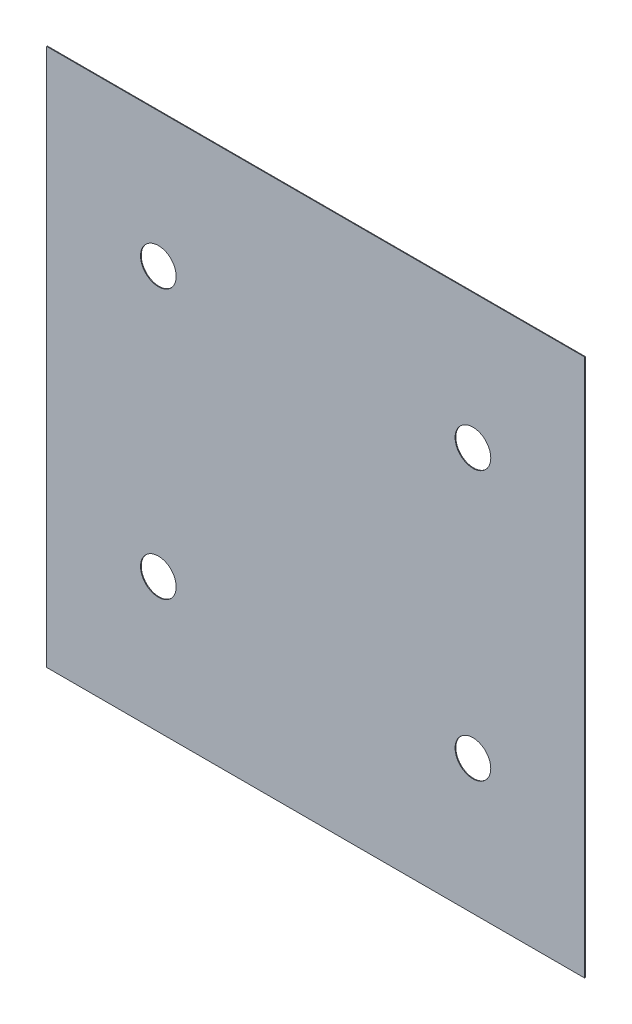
ISO-10303-21;
HEADER;
FILE_DESCRIPTION(('STEP AP214'),'2;1');
FILE_NAME('part.step','',(''),(''),'','','');
FILE_SCHEMA(('AUTOMOTIVE_DESIGN { 1 0 10303 214 1 1 1 1 }'));
ENDSEC;
DATA;
#1=APPLICATION_CONTEXT('core data for automotive mechanical design processes');
#2=APPLICATION_PROTOCOL_DEFINITION('international standard','automotive_design',2000,#1);
#3=PRODUCT_CONTEXT('',#1,'mechanical');
#4=PRODUCT('Part','Part','',(#3));
#5=PRODUCT_RELATED_PRODUCT_CATEGORY('part','',(#4));
#6=PRODUCT_DEFINITION_FORMATION('','',#4);
#7=PRODUCT_DEFINITION_CONTEXT('part definition',#1,'design');
#8=PRODUCT_DEFINITION('design','',#6,#7);
#9=PRODUCT_DEFINITION_SHAPE('','',#8);
#10=(LENGTH_UNIT() NAMED_UNIT(*) SI_UNIT(.MILLI.,.METRE.));
#11=(NAMED_UNIT(*) PLANE_ANGLE_UNIT() SI_UNIT($,.RADIAN.));
#12=(NAMED_UNIT(*) SI_UNIT($,.STERADIAN.) SOLID_ANGLE_UNIT());
#13=UNCERTAINTY_MEASURE_WITH_UNIT(LENGTH_MEASURE(1.E-05),#10,'distance_accuracy_value','');
#14=(GEOMETRIC_REPRESENTATION_CONTEXT(3) GLOBAL_UNCERTAINTY_ASSIGNED_CONTEXT((#13)) GLOBAL_UNIT_ASSIGNED_CONTEXT((#10,
#11,#12)) REPRESENTATION_CONTEXT('',''));
#15=CARTESIAN_POINT('',(0.,0.,0.));
#16=DIRECTION('',(0.,0.,1.));
#17=DIRECTION('',(1.,0.,0.));
#18=AXIS2_PLACEMENT_3D('',#15,#16,#17);
#19=CARTESIAN_POINT('',(-598.4875,598.4875,1.5875));
#20=DIRECTION('',(1.,0.,0.));
#21=DIRECTION('',(0.,1.,0.));
#22=AXIS2_PLACEMENT_3D('',#19,#20,#21);
#23=PLANE('',#22);
#24=DIRECTION('',(0.,-1.,0.));
#25=VECTOR('',#24,1.);
#26=CARTESIAN_POINT('',(-598.4875,598.4875,0.));
#27=LINE('',#26,#25);
#28=CARTESIAN_POINT('',(-598.4875,598.4875,0.));
#29=VERTEX_POINT('',#28);
#30=CARTESIAN_POINT('',(-598.4875,-598.4875,0.));
#31=VERTEX_POINT('',#30);
#32=EDGE_CURVE('E98',#29,#31,#27,.T.);
#33=ORIENTED_EDGE('',*,*,#32,.T.);
#34=DIRECTION('',(0.,0.,-1.));
#35=VECTOR('',#34,1.);
#36=CARTESIAN_POINT('',(-598.4875,-598.4875,1.5875));
#37=LINE('',#36,#35);
#38=CARTESIAN_POINT('',(-598.4875,-598.4875,1.5875));
#39=VERTEX_POINT('',#38);
#40=EDGE_CURVE('E11',#39,#31,#37,.T.);
#41=ORIENTED_EDGE('',*,*,#40,.F.);
#42=DIRECTION('',(0.,-1.,0.));
#43=VECTOR('',#42,1.);
#44=CARTESIAN_POINT('',(-598.4875,598.4875,1.5875));
#45=LINE('',#44,#43);
#46=CARTESIAN_POINT('',(-598.4875,598.4875,1.5875));
#47=VERTEX_POINT('',#46);
#48=EDGE_CURVE('E86',#47,#39,#45,.T.);
#49=ORIENTED_EDGE('',*,*,#48,.F.);
#50=DIRECTION('',(0.,0.,-1.));
#51=VECTOR('',#50,1.);
#52=CARTESIAN_POINT('',(-598.4875,598.4875,1.5875));
#53=LINE('',#52,#51);
#54=EDGE_CURVE('E94',#47,#29,#53,.T.);
#55=ORIENTED_EDGE('',*,*,#54,.T.);
#56=EDGE_LOOP('',(#33,#41,#49,#55));
#57=FACE_BOUND('',#56,.T.);
#58=ADVANCED_FACE('F35',(#57),#23,.F.);
#59=CARTESIAN_POINT('',(-598.4875,-598.4875,1.5875));
#60=DIRECTION('',(0.,1.,0.));
#61=DIRECTION('',(0.,0.,1.));
#62=AXIS2_PLACEMENT_3D('',#59,#60,#61);
#63=PLANE('',#62);
#64=DIRECTION('',(1.,0.,0.));
#65=VECTOR('',#64,1.);
#66=CARTESIAN_POINT('',(-598.4875,-598.4875,0.));
#67=LINE('',#66,#65);
#68=CARTESIAN_POINT('',(598.4875,-598.4875,0.));
#69=VERTEX_POINT('',#68);
#70=EDGE_CURVE('E90',#31,#69,#67,.T.);
#71=ORIENTED_EDGE('',*,*,#70,.T.);
#72=DIRECTION('',(0.,0.,-1.));
#73=VECTOR('',#72,1.);
#74=CARTESIAN_POINT('',(598.4875,-598.4875,1.5875));
#75=LINE('',#74,#73);
#76=CARTESIAN_POINT('',(598.4875,-598.4875,1.5875));
#77=VERTEX_POINT('',#76);
#78=EDGE_CURVE('E43',#77,#69,#75,.T.);
#79=ORIENTED_EDGE('',*,*,#78,.F.);
#80=DIRECTION('',(1.,0.,0.));
#81=VECTOR('',#80,1.);
#82=CARTESIAN_POINT('',(-598.4875,-598.4875,1.5875));
#83=LINE('',#82,#81);
#84=EDGE_CURVE('E81',#39,#77,#83,.T.);
#85=ORIENTED_EDGE('',*,*,#84,.F.);
#86=ORIENTED_EDGE('',*,*,#40,.T.);
#87=EDGE_LOOP('',(#71,#79,#85,#86));
#88=FACE_BOUND('',#87,.T.);
#89=ADVANCED_FACE('F89',(#88),#63,.F.);
#90=CARTESIAN_POINT('',(598.4875,598.4875,1.5875));
#91=DIRECTION('',(-1.,0.,0.));
#92=DIRECTION('',(0.,0.,1.));
#93=AXIS2_PLACEMENT_3D('',#90,#91,#92);
#94=PLANE('',#93);
#95=DIRECTION('',(0.,1.,0.));
#96=VECTOR('',#95,1.);
#97=CARTESIAN_POINT('',(598.4875,598.4875,0.));
#98=LINE('',#97,#96);
#99=CARTESIAN_POINT('',(598.4875,598.4875,0.));
#100=VERTEX_POINT('',#99);
#101=EDGE_CURVE('E68',#69,#100,#98,.T.);
#102=ORIENTED_EDGE('',*,*,#101,.T.);
#103=DIRECTION('',(0.,0.,-1.));
#104=VECTOR('',#103,1.);
#105=CARTESIAN_POINT('',(598.4875,598.4875,1.5875));
#106=LINE('',#105,#104);
#107=CARTESIAN_POINT('',(598.4875,598.4875,1.5875));
#108=VERTEX_POINT('',#107);
#109=EDGE_CURVE('E91',#108,#100,#106,.T.);
#110=ORIENTED_EDGE('',*,*,#109,.F.);
#111=DIRECTION('',(0.,1.,0.));
#112=VECTOR('',#111,1.);
#113=CARTESIAN_POINT('',(598.4875,598.4875,1.5875));
#114=LINE('',#113,#112);
#115=EDGE_CURVE('E84',#77,#108,#114,.T.);
#116=ORIENTED_EDGE('',*,*,#115,.F.);
#117=ORIENTED_EDGE('',*,*,#78,.T.);
#118=EDGE_LOOP('',(#102,#110,#116,#117));
#119=FACE_BOUND('',#118,.T.);
#120=ADVANCED_FACE('F92',(#119),#94,.F.);
#121=CARTESIAN_POINT('',(-598.4875,598.4875,1.5875));
#122=DIRECTION('',(0.,-1.,0.));
#123=DIRECTION('',(0.,0.,-1.));
#124=AXIS2_PLACEMENT_3D('',#121,#122,#123);
#125=PLANE('',#124);
#126=DIRECTION('',(-1.,0.,0.));
#127=VECTOR('',#126,1.);
#128=CARTESIAN_POINT('',(-598.4875,598.4875,0.));
#129=LINE('',#128,#127);
#130=EDGE_CURVE('E74',#100,#29,#129,.T.);
#131=ORIENTED_EDGE('',*,*,#130,.T.);
#132=ORIENTED_EDGE('',*,*,#54,.F.);
#133=DIRECTION('',(-1.,0.,0.));
#134=VECTOR('',#133,1.);
#135=CARTESIAN_POINT('',(-598.4875,598.4875,1.5875));
#136=LINE('',#135,#134);
#137=EDGE_CURVE('E51',#108,#47,#136,.T.);
#138=ORIENTED_EDGE('',*,*,#137,.F.);
#139=ORIENTED_EDGE('',*,*,#109,.T.);
#140=EDGE_LOOP('',(#131,#132,#138,#139));
#141=FACE_BOUND('',#140,.T.);
#142=ADVANCED_FACE('F106',(#141),#125,.F.);
#143=CARTESIAN_POINT('',(0.,0.,1.5875));
#144=DIRECTION('',(0.,0.,1.));
#145=DIRECTION('',(1.,0.,0.));
#146=AXIS2_PLACEMENT_3D('',#143,#144,#145);
#147=PLANE('',#146);
#148=CARTESIAN_POINT('',(-350.04375,-299.24375,1.5875));
#149=DIRECTION('',(0.,0.,1.));
#150=DIRECTION('',(1.,0.,0.));
#151=AXIS2_PLACEMENT_3D('',#148,#149,#150);
#152=CIRCLE('',#151,39.6875);
#153=CARTESIAN_POINT('',(-310.35625,-299.24375,1.5875));
#154=VERTEX_POINT('',#153);
#155=EDGE_CURVE('E101',#154,#154,#152,.F.);
#156=ORIENTED_EDGE('',*,*,#155,.T.);
#157=EDGE_LOOP('',(#156));
#158=FACE_BOUND('',#157,.T.);
#159=CARTESIAN_POINT('',(350.04375,299.24375,1.5875));
#160=DIRECTION('',(0.,0.,1.));
#161=DIRECTION('',(1.,0.,0.));
#162=AXIS2_PLACEMENT_3D('',#159,#160,#161);
#163=CIRCLE('',#162,39.6875);
#164=CARTESIAN_POINT('',(389.73125,299.24375,1.5875));
#165=VERTEX_POINT('',#164);
#166=EDGE_CURVE('E114',#165,#165,#163,.F.);
#167=ORIENTED_EDGE('',*,*,#166,.T.);
#168=EDGE_LOOP('',(#167));
#169=FACE_BOUND('',#168,.T.);
#170=CARTESIAN_POINT('',(350.04375,-299.24375,1.5875));
#171=DIRECTION('',(0.,0.,1.));
#172=DIRECTION('',(1.,0.,0.));
#173=AXIS2_PLACEMENT_3D('',#170,#171,#172);
#174=CIRCLE('',#173,39.6875);
#175=CARTESIAN_POINT('',(389.73125,-299.24375,1.5875));
#176=VERTEX_POINT('',#175);
#177=EDGE_CURVE('E117',#176,#176,#174,.F.);
#178=ORIENTED_EDGE('',*,*,#177,.T.);
#179=EDGE_LOOP('',(#178));
#180=FACE_BOUND('',#179,.T.);
#181=CARTESIAN_POINT('',(-350.04375,299.24375,1.5875));
#182=DIRECTION('',(0.,0.,1.));
#183=DIRECTION('',(1.,0.,0.));
#184=AXIS2_PLACEMENT_3D('',#181,#182,#183);
#185=CIRCLE('',#184,39.6875);
#186=CARTESIAN_POINT('',(-310.35625,299.24375,1.5875));
#187=VERTEX_POINT('',#186);
#188=EDGE_CURVE('E120',#187,#187,#185,.F.);
#189=ORIENTED_EDGE('',*,*,#188,.T.);
#190=EDGE_LOOP('',(#189));
#191=FACE_BOUND('',#190,.T.);
#192=ORIENTED_EDGE('',*,*,#48,.T.);
#193=ORIENTED_EDGE('',*,*,#84,.T.);
#194=ORIENTED_EDGE('',*,*,#115,.T.);
#195=ORIENTED_EDGE('',*,*,#137,.T.);
#196=EDGE_LOOP('',(#192,#193,#194,#195));
#197=FACE_BOUND('',#196,.T.);
#198=ADVANCED_FACE('F82',(#158,#169,#180,#191,#197),#147,.T.);
#199=CARTESIAN_POINT('',(0.,0.,0.));
#200=DIRECTION('',(0.,0.,1.));
#201=DIRECTION('',(1.,0.,0.));
#202=AXIS2_PLACEMENT_3D('',#199,#200,#201);
#203=PLANE('',#202);
#204=CARTESIAN_POINT('',(-350.04375,-299.24375,0.));
#205=DIRECTION('',(0.,0.,1.));
#206=DIRECTION('',(1.,0.,0.));
#207=AXIS2_PLACEMENT_3D('',#204,#205,#206);
#208=CIRCLE('',#207,39.6875);
#209=CARTESIAN_POINT('',(-310.35625,-299.24375,0.));
#210=VERTEX_POINT('',#209);
#211=EDGE_CURVE('E126',#210,#210,#208,.T.);
#212=ORIENTED_EDGE('',*,*,#211,.T.);
#213=EDGE_LOOP('',(#212));
#214=FACE_BOUND('',#213,.T.);
#215=CARTESIAN_POINT('',(350.04375,299.24375,0.));
#216=DIRECTION('',(0.,0.,1.));
#217=DIRECTION('',(1.,0.,0.));
#218=AXIS2_PLACEMENT_3D('',#215,#216,#217);
#219=CIRCLE('',#218,39.6875);
#220=CARTESIAN_POINT('',(389.73125,299.24375,0.));
#221=VERTEX_POINT('',#220);
#222=EDGE_CURVE('E127',#221,#221,#219,.T.);
#223=ORIENTED_EDGE('',*,*,#222,.T.);
#224=EDGE_LOOP('',(#223));
#225=FACE_BOUND('',#224,.T.);
#226=CARTESIAN_POINT('',(350.04375,-299.24375,0.));
#227=DIRECTION('',(0.,0.,1.));
#228=DIRECTION('',(1.,0.,0.));
#229=AXIS2_PLACEMENT_3D('',#226,#227,#228);
#230=CIRCLE('',#229,39.6875);
#231=CARTESIAN_POINT('',(389.73125,-299.24375,0.));
#232=VERTEX_POINT('',#231);
#233=EDGE_CURVE('E130',#232,#232,#230,.T.);
#234=ORIENTED_EDGE('',*,*,#233,.T.);
#235=EDGE_LOOP('',(#234));
#236=FACE_BOUND('',#235,.T.);
#237=CARTESIAN_POINT('',(-350.04375,299.24375,0.));
#238=DIRECTION('',(0.,0.,1.));
#239=DIRECTION('',(1.,0.,0.));
#240=AXIS2_PLACEMENT_3D('',#237,#238,#239);
#241=CIRCLE('',#240,39.6875);
#242=CARTESIAN_POINT('',(-310.35625,299.24375,0.));
#243=VERTEX_POINT('',#242);
#244=EDGE_CURVE('E123',#243,#243,#241,.T.);
#245=ORIENTED_EDGE('',*,*,#244,.T.);
#246=EDGE_LOOP('',(#245));
#247=FACE_BOUND('',#246,.T.);
#248=ORIENTED_EDGE('',*,*,#32,.F.);
#249=ORIENTED_EDGE('',*,*,#130,.F.);
#250=ORIENTED_EDGE('',*,*,#101,.F.);
#251=ORIENTED_EDGE('',*,*,#70,.F.);
#252=EDGE_LOOP('',(#248,#249,#250,#251));
#253=FACE_BOUND('',#252,.T.);
#254=ADVANCED_FACE('F109',(#214,#225,#236,#247,#253),#203,.F.);
#255=CARTESIAN_POINT('',(-350.04375,299.24375,2.54));
#256=DIRECTION('',(0.,0.,-1.));
#257=DIRECTION('',(-1.,0.,0.));
#258=AXIS2_PLACEMENT_3D('',#255,#256,#257);
#259=CYLINDRICAL_SURFACE('',#258,39.6875);
#260=ORIENTED_EDGE('',*,*,#188,.F.);
#261=EDGE_LOOP('',(#260));
#262=FACE_BOUND('',#261,.T.);
#263=ORIENTED_EDGE('',*,*,#244,.F.);
#264=EDGE_LOOP('',(#263));
#265=FACE_BOUND('',#264,.T.);
#266=ADVANCED_FACE('F141',(#262,#265),#259,.F.);
#267=CARTESIAN_POINT('',(350.04375,-299.24375,2.54));
#268=DIRECTION('',(0.,0.,-1.));
#269=DIRECTION('',(-1.,0.,0.));
#270=AXIS2_PLACEMENT_3D('',#267,#268,#269);
#271=CYLINDRICAL_SURFACE('',#270,39.6875);
#272=ORIENTED_EDGE('',*,*,#177,.F.);
#273=EDGE_LOOP('',(#272));
#274=FACE_BOUND('',#273,.T.);
#275=ORIENTED_EDGE('',*,*,#233,.F.);
#276=EDGE_LOOP('',(#275));
#277=FACE_BOUND('',#276,.T.);
#278=ADVANCED_FACE('F138',(#274,#277),#271,.F.);
#279=CARTESIAN_POINT('',(350.04375,299.24375,2.54));
#280=DIRECTION('',(0.,0.,-1.));
#281=DIRECTION('',(-1.,0.,0.));
#282=AXIS2_PLACEMENT_3D('',#279,#280,#281);
#283=CYLINDRICAL_SURFACE('',#282,39.6875);
#284=ORIENTED_EDGE('',*,*,#166,.F.);
#285=EDGE_LOOP('',(#284));
#286=FACE_BOUND('',#285,.T.);
#287=ORIENTED_EDGE('',*,*,#222,.F.);
#288=EDGE_LOOP('',(#287));
#289=FACE_BOUND('',#288,.T.);
#290=ADVANCED_FACE('F140',(#286,#289),#283,.F.);
#291=CARTESIAN_POINT('',(-350.04375,-299.24375,2.54));
#292=DIRECTION('',(0.,0.,-1.));
#293=DIRECTION('',(-1.,0.,0.));
#294=AXIS2_PLACEMENT_3D('',#291,#292,#293);
#295=CYLINDRICAL_SURFACE('',#294,39.6875);
#296=ORIENTED_EDGE('',*,*,#155,.F.);
#297=EDGE_LOOP('',(#296));
#298=FACE_BOUND('',#297,.T.);
#299=ORIENTED_EDGE('',*,*,#211,.F.);
#300=EDGE_LOOP('',(#299));
#301=FACE_BOUND('',#300,.T.);
#302=ADVANCED_FACE('F148',(#298,#301),#295,.F.);
#303=CLOSED_SHELL('',(#58,#89,#120,#142,#198,#254,#266,#278,#290,#302));
#304=MANIFOLD_SOLID_BREP('B2',#303);
#305=ADVANCED_BREP_SHAPE_REPRESENTATION('',(#18,#304),#14);
#306=SHAPE_DEFINITION_REPRESENTATION(#9,#305);
ENDSEC;
END-ISO-10303-21;
